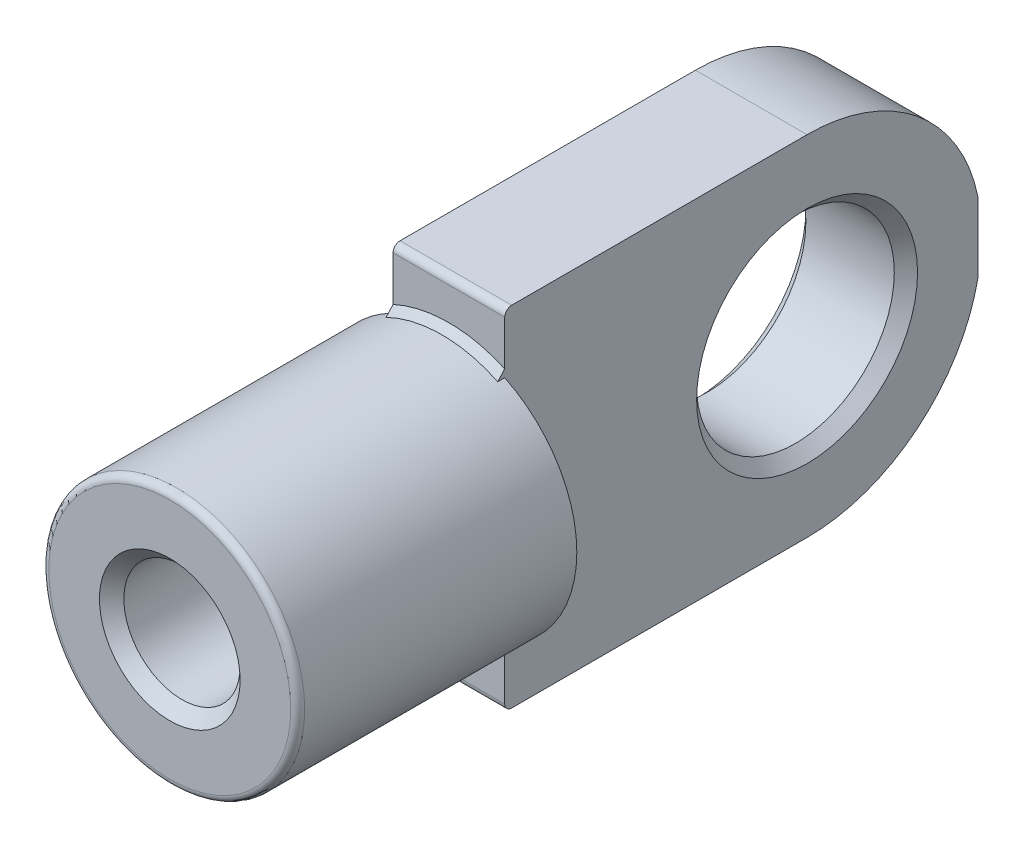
ISO-10303-21;
HEADER;
FILE_DESCRIPTION(('STEP AP214'),'2;1');
FILE_NAME('part.step','',(''),(''),'','','');
FILE_SCHEMA(('AUTOMOTIVE_DESIGN { 1 0 10303 214 1 1 1 1 }'));
ENDSEC;
DATA;
#1=APPLICATION_CONTEXT('core data for automotive mechanical design processes');
#2=APPLICATION_PROTOCOL_DEFINITION('international standard','automotive_design',2000,#1);
#3=PRODUCT_CONTEXT('',#1,'mechanical');
#4=PRODUCT('Part','Part','',(#3));
#5=PRODUCT_RELATED_PRODUCT_CATEGORY('part','',(#4));
#6=PRODUCT_DEFINITION_FORMATION('','',#4);
#7=PRODUCT_DEFINITION_CONTEXT('part definition',#1,'design');
#8=PRODUCT_DEFINITION('design','',#6,#7);
#9=PRODUCT_DEFINITION_SHAPE('','',#8);
#10=(LENGTH_UNIT() NAMED_UNIT(*) SI_UNIT(.MILLI.,.METRE.));
#11=(NAMED_UNIT(*) PLANE_ANGLE_UNIT() SI_UNIT($,.RADIAN.));
#12=(NAMED_UNIT(*) SI_UNIT($,.STERADIAN.) SOLID_ANGLE_UNIT());
#13=UNCERTAINTY_MEASURE_WITH_UNIT(LENGTH_MEASURE(1.E-05),#10,'distance_accuracy_value','');
#14=(GEOMETRIC_REPRESENTATION_CONTEXT(3) GLOBAL_UNCERTAINTY_ASSIGNED_CONTEXT((#13)) GLOBAL_UNIT_ASSIGNED_CONTEXT((#10,
#11,#12)) REPRESENTATION_CONTEXT('',''));
#15=CARTESIAN_POINT('',(0.,0.,0.));
#16=DIRECTION('',(0.,0.,1.));
#17=DIRECTION('',(1.,0.,0.));
#18=AXIS2_PLACEMENT_3D('',#15,#16,#17);
#19=CARTESIAN_POINT('',(-2.4,7.5,13.));
#20=DIRECTION('',(0.,0.,1.));
#21=DIRECTION('',(1.,0.,0.));
#22=AXIS2_PLACEMENT_3D('',#19,#20,#21);
#23=PLANE('',#22);
#24=DIRECTION('',(0.,-1.,0.));
#25=VECTOR('',#24,1.);
#26=CARTESIAN_POINT('',(-2.4,7.5,13.));
#27=LINE('',#26,#25);
#28=CARTESIAN_POINT('',(-2.4,7.2,13.));
#29=VERTEX_POINT('',#28);
#30=CARTESIAN_POINT('',(-2.4,5.28015151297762,13.));
#31=VERTEX_POINT('',#30);
#32=EDGE_CURVE('E207',#29,#31,#27,.T.);
#33=ORIENTED_EDGE('',*,*,#32,.T.);
#34=CARTESIAN_POINT('',(0.,0.,13.));
#35=DIRECTION('',(0.,0.,1.));
#36=DIRECTION('',(1.,0.,0.));
#37=AXIS2_PLACEMENT_3D('',#34,#35,#36);
#38=CIRCLE('',#37,5.79999999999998);
#39=CARTESIAN_POINT('',(2.4,5.28015151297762,13.));
#40=VERTEX_POINT('',#39);
#41=EDGE_CURVE('E296',#31,#40,#38,.F.);
#42=ORIENTED_EDGE('',*,*,#41,.T.);
#43=DIRECTION('',(0.,-1.,0.));
#44=VECTOR('',#43,1.);
#45=CARTESIAN_POINT('',(2.4,7.5,13.));
#46=LINE('',#45,#44);
#47=CARTESIAN_POINT('',(2.4,7.2,13.));
#48=VERTEX_POINT('',#47);
#49=EDGE_CURVE('E189',#48,#40,#46,.T.);
#50=ORIENTED_EDGE('',*,*,#49,.F.);
#51=DIRECTION('',(1.,0.,0.));
#52=VECTOR('',#51,1.);
#53=CARTESIAN_POINT('',(-2.4,7.2,13.));
#54=LINE('',#53,#52);
#55=EDGE_CURVE('E262',#48,#29,#54,.F.);
#56=ORIENTED_EDGE('',*,*,#55,.T.);
#57=EDGE_LOOP('',(#33,#42,#50,#56));
#58=FACE_BOUND('',#57,.T.);
#59=ADVANCED_FACE('F43',(#58),#23,.T.);
#60=CARTESIAN_POINT('',(-2.4,7.5,13.));
#61=DIRECTION('',(0.,1.,0.));
#62=DIRECTION('',(0.,0.,1.));
#63=AXIS2_PLACEMENT_3D('',#60,#61,#62);
#64=PLANE('',#63);
#65=DIRECTION('',(0.,0.,1.));
#66=VECTOR('',#65,1.);
#67=CARTESIAN_POINT('',(-2.4,7.5,13.));
#68=LINE('',#67,#66);
#69=CARTESIAN_POINT('',(-2.4,7.5,0.));
#70=VERTEX_POINT('',#69);
#71=CARTESIAN_POINT('',(-2.4,7.5,12.7));
#72=VERTEX_POINT('',#71);
#73=EDGE_CURVE('E203',#70,#72,#68,.T.);
#74=ORIENTED_EDGE('',*,*,#73,.T.);
#75=DIRECTION('',(1.,0.,0.));
#76=VECTOR('',#75,1.);
#77=CARTESIAN_POINT('',(-2.4,7.5,12.7));
#78=LINE('',#77,#76);
#79=CARTESIAN_POINT('',(2.4,7.5,12.7));
#80=VERTEX_POINT('',#79);
#81=EDGE_CURVE('E259',#72,#80,#78,.T.);
#82=ORIENTED_EDGE('',*,*,#81,.T.);
#83=DIRECTION('',(0.,0.,1.));
#84=VECTOR('',#83,1.);
#85=CARTESIAN_POINT('',(2.4,7.5,13.));
#86=LINE('',#85,#84);
#87=CARTESIAN_POINT('',(2.4,7.5,0.));
#88=VERTEX_POINT('',#87);
#89=EDGE_CURVE('E185',#88,#80,#86,.T.);
#90=ORIENTED_EDGE('',*,*,#89,.F.);
#91=DIRECTION('',(1.,0.,0.));
#92=VECTOR('',#91,1.);
#93=CARTESIAN_POINT('',(-2.4,7.5,0.));
#94=LINE('',#93,#92);
#95=EDGE_CURVE('E222',#70,#88,#94,.T.);
#96=ORIENTED_EDGE('',*,*,#95,.F.);
#97=EDGE_LOOP('',(#74,#82,#90,#96));
#98=FACE_BOUND('',#97,.T.);
#99=ADVANCED_FACE('F393',(#98),#64,.T.);
#100=CARTESIAN_POINT('',(-2.4,0.,0.));
#101=DIRECTION('',(1.,0.,0.));
#102=DIRECTION('',(0.,0.,-1.));
#103=AXIS2_PLACEMENT_3D('',#100,#101,#102);
#104=CYLINDRICAL_SURFACE('',#103,7.5);
#105=CARTESIAN_POINT('',(2.4,0.,0.));
#106=DIRECTION('',(1.,0.,0.));
#107=DIRECTION('',(0.,0.,-1.));
#108=AXIS2_PLACEMENT_3D('',#105,#106,#107);
#109=CIRCLE('',#108,7.5);
#110=CARTESIAN_POINT('',(2.4,1.53060556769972,-7.34215544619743));
#111=VERTEX_POINT('',#110);
#112=EDGE_CURVE('E201',#111,#88,#109,.T.);
#113=ORIENTED_EDGE('',*,*,#112,.F.);
#114=DIRECTION('',(1.,0.,0.));
#115=VECTOR('',#114,1.);
#116=CARTESIAN_POINT('',(-2.4,1.53060556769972,-7.34215544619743));
#117=LINE('',#116,#115);
#118=CARTESIAN_POINT('',(-2.4,1.53060556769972,-7.34215544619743));
#119=VERTEX_POINT('',#118);
#120=EDGE_CURVE('E252',#111,#119,#117,.F.);
#121=ORIENTED_EDGE('',*,*,#120,.T.);
#122=CARTESIAN_POINT('',(-2.4,0.,0.));
#123=DIRECTION('',(1.,0.,0.));
#124=DIRECTION('',(0.,0.,-1.));
#125=AXIS2_PLACEMENT_3D('',#122,#123,#124);
#126=CIRCLE('',#125,7.5);
#127=EDGE_CURVE('E219',#119,#70,#126,.T.);
#128=ORIENTED_EDGE('',*,*,#127,.T.);
#129=ORIENTED_EDGE('',*,*,#95,.T.);
#130=EDGE_LOOP('',(#113,#121,#128,#129));
#131=FACE_BOUND('',#130,.T.);
#132=ADVANCED_FACE('F333',(#131),#104,.T.);
#133=CARTESIAN_POINT('',(-2.4,1.5,-7.34846922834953));
#134=DIRECTION('',(0.,0.,-1.));
#135=DIRECTION('',(-1.,0.,0.));
#136=AXIS2_PLACEMENT_3D('',#133,#134,#135);
#137=PLANE('',#136);
#138=DIRECTION('',(0.,1.,0.));
#139=VECTOR('',#138,1.);
#140=CARTESIAN_POINT('',(2.4,1.5,-7.34846922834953));
#141=LINE('',#140,#139);
#142=CARTESIAN_POINT('',(2.4,-1.46938134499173,-7.34846922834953));
#143=VERTEX_POINT('',#142);
#144=CARTESIAN_POINT('',(2.4,1.46938134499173,-7.34846922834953));
#145=VERTEX_POINT('',#144);
#146=EDGE_CURVE('E198',#143,#145,#141,.T.);
#147=ORIENTED_EDGE('',*,*,#146,.F.);
#148=DIRECTION('',(1.,0.,0.));
#149=VECTOR('',#148,1.);
#150=CARTESIAN_POINT('',(-2.4,-1.46938134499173,-7.34846922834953));
#151=LINE('',#150,#149);
#152=CARTESIAN_POINT('',(-2.4,-1.46938134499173,-7.34846922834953));
#153=VERTEX_POINT('',#152);
#154=EDGE_CURVE('E241',#143,#153,#151,.F.);
#155=ORIENTED_EDGE('',*,*,#154,.T.);
#156=DIRECTION('',(0.,1.,0.));
#157=VECTOR('',#156,1.);
#158=CARTESIAN_POINT('',(-2.4,1.5,-7.34846922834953));
#159=LINE('',#158,#157);
#160=CARTESIAN_POINT('',(-2.4,1.46938134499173,-7.34846922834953));
#161=VERTEX_POINT('',#160);
#162=EDGE_CURVE('E216',#153,#161,#159,.T.);
#163=ORIENTED_EDGE('',*,*,#162,.T.);
#164=DIRECTION('',(1.,0.,0.));
#165=VECTOR('',#164,1.);
#166=CARTESIAN_POINT('',(-2.4,1.46938134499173,-7.34846922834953));
#167=LINE('',#166,#165);
#168=EDGE_CURVE('E238',#161,#145,#167,.T.);
#169=ORIENTED_EDGE('',*,*,#168,.T.);
#170=EDGE_LOOP('',(#147,#155,#163,#169));
#171=FACE_BOUND('',#170,.T.);
#172=ADVANCED_FACE('F378',(#171),#137,.T.);
#173=CARTESIAN_POINT('',(-2.4,0.,0.));
#174=DIRECTION('',(1.,0.,0.));
#175=DIRECTION('',(0.,0.,-1.));
#176=AXIS2_PLACEMENT_3D('',#173,#174,#175);
#177=CYLINDRICAL_SURFACE('',#176,7.5);
#178=CARTESIAN_POINT('',(-2.4,0.,0.));
#179=DIRECTION('',(1.,0.,0.));
#180=DIRECTION('',(0.,0.,-1.));
#181=AXIS2_PLACEMENT_3D('',#178,#179,#180);
#182=CIRCLE('',#181,7.5);
#183=CARTESIAN_POINT('',(-2.4,-7.5,0.));
#184=VERTEX_POINT('',#183);
#185=CARTESIAN_POINT('',(-2.4,-1.53060556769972,-7.34215544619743));
#186=VERTEX_POINT('',#185);
#187=EDGE_CURVE('E213',#184,#186,#182,.T.);
#188=ORIENTED_EDGE('',*,*,#187,.T.);
#189=DIRECTION('',(1.,0.,0.));
#190=VECTOR('',#189,1.);
#191=CARTESIAN_POINT('',(-2.4,-1.53060556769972,-7.34215544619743));
#192=LINE('',#191,#190);
#193=CARTESIAN_POINT('',(2.4,-1.53060556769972,-7.34215544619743));
#194=VERTEX_POINT('',#193);
#195=EDGE_CURVE('E225',#186,#194,#192,.T.);
#196=ORIENTED_EDGE('',*,*,#195,.T.);
#197=CARTESIAN_POINT('',(2.4,0.,0.));
#198=DIRECTION('',(1.,0.,0.));
#199=DIRECTION('',(0.,0.,-1.));
#200=AXIS2_PLACEMENT_3D('',#197,#198,#199);
#201=CIRCLE('',#200,7.5);
#202=CARTESIAN_POINT('',(2.4,-7.5,0.));
#203=VERTEX_POINT('',#202);
#204=EDGE_CURVE('E195',#203,#194,#201,.T.);
#205=ORIENTED_EDGE('',*,*,#204,.F.);
#206=DIRECTION('',(1.,0.,0.));
#207=VECTOR('',#206,1.);
#208=CARTESIAN_POINT('',(-2.4,-7.5,0.));
#209=LINE('',#208,#207);
#210=EDGE_CURVE('E221',#184,#203,#209,.T.);
#211=ORIENTED_EDGE('',*,*,#210,.F.);
#212=EDGE_LOOP('',(#188,#196,#205,#211));
#213=FACE_BOUND('',#212,.T.);
#214=ADVANCED_FACE('F372',(#213),#177,.T.);
#215=CARTESIAN_POINT('',(-2.4,-7.5,13.));
#216=DIRECTION('',(0.,-1.,0.));
#217=DIRECTION('',(0.,0.,-1.));
#218=AXIS2_PLACEMENT_3D('',#215,#216,#217);
#219=PLANE('',#218);
#220=DIRECTION('',(0.,0.,-1.));
#221=VECTOR('',#220,1.);
#222=CARTESIAN_POINT('',(2.4,-7.5,13.));
#223=LINE('',#222,#221);
#224=CARTESIAN_POINT('',(2.4,-7.5,12.7));
#225=VERTEX_POINT('',#224);
#226=EDGE_CURVE('E192',#225,#203,#223,.T.);
#227=ORIENTED_EDGE('',*,*,#226,.F.);
#228=DIRECTION('',(1.,0.,0.));
#229=VECTOR('',#228,1.);
#230=CARTESIAN_POINT('',(-2.4,-7.5,12.7));
#231=LINE('',#230,#229);
#232=CARTESIAN_POINT('',(-2.4,-7.5,12.7));
#233=VERTEX_POINT('',#232);
#234=EDGE_CURVE('E257',#225,#233,#231,.F.);
#235=ORIENTED_EDGE('',*,*,#234,.T.);
#236=DIRECTION('',(0.,0.,-1.));
#237=VECTOR('',#236,1.);
#238=CARTESIAN_POINT('',(-2.4,-7.5,13.));
#239=LINE('',#238,#237);
#240=EDGE_CURVE('E210',#233,#184,#239,.T.);
#241=ORIENTED_EDGE('',*,*,#240,.T.);
#242=ORIENTED_EDGE('',*,*,#210,.T.);
#243=EDGE_LOOP('',(#227,#235,#241,#242));
#244=FACE_BOUND('',#243,.T.);
#245=ADVANCED_FACE('F369',(#244),#219,.T.);
#246=CARTESIAN_POINT('',(2.4,-5.28015151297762,13.));
#247=VERTEX_POINT('',#246);
#248=CARTESIAN_POINT('',(2.4,-7.2,13.));
#249=VERTEX_POINT('',#248);
#250=EDGE_CURVE('E188',#247,#249,#46,.T.);
#251=ORIENTED_EDGE('',*,*,#250,.F.);
#252=CARTESIAN_POINT('',(0.,0.,13.));
#253=DIRECTION('',(0.,0.,1.));
#254=DIRECTION('',(1.,0.,0.));
#255=AXIS2_PLACEMENT_3D('',#252,#253,#254);
#256=CIRCLE('',#255,5.79999999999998);
#257=CARTESIAN_POINT('',(-2.4,-5.28015151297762,13.));
#258=VERTEX_POINT('',#257);
#259=EDGE_CURVE('E294',#247,#258,#256,.F.);
#260=ORIENTED_EDGE('',*,*,#259,.T.);
#261=CARTESIAN_POINT('',(-2.4,-7.2,13.));
#262=VERTEX_POINT('',#261);
#263=EDGE_CURVE('E206',#258,#262,#27,.T.);
#264=ORIENTED_EDGE('',*,*,#263,.T.);
#265=DIRECTION('',(1.,0.,0.));
#266=VECTOR('',#265,1.);
#267=CARTESIAN_POINT('',(-2.4,-7.2,13.));
#268=LINE('',#267,#266);
#269=EDGE_CURVE('E254',#262,#249,#268,.T.);
#270=ORIENTED_EDGE('',*,*,#269,.T.);
#271=EDGE_LOOP('',(#251,#260,#264,#270));
#272=FACE_BOUND('',#271,.T.);
#273=ADVANCED_FACE('F331',(#272),#23,.T.);
#274=CARTESIAN_POINT('',(-2.4,0.,0.));
#275=DIRECTION('',(1.,0.,0.));
#276=DIRECTION('',(0.,0.,-1.));
#277=AXIS2_PLACEMENT_3D('',#274,#275,#276);
#278=PLANE('',#277);
#279=CARTESIAN_POINT('',(-2.4,0.,0.));
#280=DIRECTION('',(1.,0.,0.));
#281=DIRECTION('',(0.,0.,-1.));
#282=AXIS2_PLACEMENT_3D('',#279,#280,#281);
#283=CIRCLE('',#282,4.75);
#284=CARTESIAN_POINT('',(-2.4,0.,-4.75));
#285=VERTEX_POINT('',#284);
#286=EDGE_CURVE('E270',#285,#285,#283,.T.);
#287=ORIENTED_EDGE('',*,*,#286,.T.);
#288=EDGE_LOOP('',(#287));
#289=FACE_BOUND('',#288,.T.);
#290=ORIENTED_EDGE('',*,*,#162,.F.);
#291=CARTESIAN_POINT('',(-2.4,-1.46938134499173,-7.04846922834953));
#292=DIRECTION('',(1.,0.,0.));
#293=DIRECTION('',(0.,0.,-1.));
#294=AXIS2_PLACEMENT_3D('',#291,#292,#293);
#295=CIRCLE('',#294,0.3);
#296=EDGE_CURVE('E250',#153,#186,#295,.F.);
#297=ORIENTED_EDGE('',*,*,#296,.T.);
#298=ORIENTED_EDGE('',*,*,#187,.F.);
#299=ORIENTED_EDGE('',*,*,#240,.F.);
#300=CARTESIAN_POINT('',(-2.4,-7.2,12.7));
#301=DIRECTION('',(1.,0.,0.));
#302=DIRECTION('',(0.,0.,-1.));
#303=AXIS2_PLACEMENT_3D('',#300,#301,#302);
#304=CIRCLE('',#303,0.3);
#305=EDGE_CURVE('E245',#233,#262,#304,.F.);
#306=ORIENTED_EDGE('',*,*,#305,.T.);
#307=ORIENTED_EDGE('',*,*,#263,.F.);
#308=CARTESIAN_POINT('',(-2.4,-5.28015151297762,13.));
#309=CARTESIAN_POINT('',(-2.4,-5.2250613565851,13.050160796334));
#310=CARTESIAN_POINT('',(-2.4,-5.169898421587,13.1002411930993));
#311=CARTESIAN_POINT('',(-2.4,-5.05942698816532,13.2002411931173));
#312=CARTESIAN_POINT('',(-2.4,-5.00411848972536,13.2501607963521));
#313=CARTESIAN_POINT('',(-2.4,-4.94873721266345,13.3));
#314=B_SPLINE_CURVE_WITH_KNOTS('',3,(#308,#309,#310,#311,#312,#313),.UNSPECIFIED.,.F.,.F.,(4,2,
4),(0.,0.223515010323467,0.447030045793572),.UNSPECIFIED.);
#315=CARTESIAN_POINT('',(-2.4,-4.94873721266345,13.3));
#316=VERTEX_POINT('',#315);
#317=EDGE_CURVE('E304',#258,#316,#314,.T.);
#318=ORIENTED_EDGE('',*,*,#317,.T.);
#319=DIRECTION('',(0.,0.,-1.));
#320=VECTOR('',#319,1.);
#321=CARTESIAN_POINT('',(-2.4,-4.94873721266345,13.));
#322=LINE('',#321,#320);
#323=CARTESIAN_POINT('',(-2.4,-4.94873721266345,13.));
#324=VERTEX_POINT('',#323);
#325=EDGE_CURVE('E72',#324,#316,#322,.F.);
#326=ORIENTED_EDGE('',*,*,#325,.F.);
#327=CARTESIAN_POINT('',(-2.4,4.94873721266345,13.));
#328=VERTEX_POINT('',#327);
#329=EDGE_CURVE('E211',#328,#324,#27,.T.);
#330=ORIENTED_EDGE('',*,*,#329,.F.);
#331=DIRECTION('',(0.,0.,-1.));
#332=VECTOR('',#331,1.);
#333=CARTESIAN_POINT('',(-2.4,4.94873721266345,13.3));
#334=LINE('',#333,#332);
#335=CARTESIAN_POINT('',(-2.4,4.94873721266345,13.3));
#336=VERTEX_POINT('',#335);
#337=EDGE_CURVE('E286',#336,#328,#334,.T.);
#338=ORIENTED_EDGE('',*,*,#337,.F.);
#339=CARTESIAN_POINT('',(-2.4,4.94873721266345,13.3));
#340=CARTESIAN_POINT('',(-2.4,5.00411848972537,13.2501607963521));
#341=CARTESIAN_POINT('',(-2.4,5.05942698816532,13.2002411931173));
#342=CARTESIAN_POINT('',(-2.4,5.169898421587,13.1002411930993));
#343=CARTESIAN_POINT('',(-2.4,5.2250613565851,13.050160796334));
#344=CARTESIAN_POINT('',(-2.4,5.28015151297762,13.));
#345=B_SPLINE_CURVE_WITH_KNOTS('',3,(#339,#340,#341,#342,#343,#344),.UNSPECIFIED.,.F.,.F.,(4,2,
4),(0.,0.223515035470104,0.44703004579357),.UNSPECIFIED.);
#346=EDGE_CURVE('E58',#336,#31,#345,.T.);
#347=ORIENTED_EDGE('',*,*,#346,.T.);
#348=ORIENTED_EDGE('',*,*,#32,.F.);
#349=CARTESIAN_POINT('',(-2.4,7.2,12.7));
#350=DIRECTION('',(1.,0.,0.));
#351=DIRECTION('',(0.,0.,-1.));
#352=AXIS2_PLACEMENT_3D('',#349,#350,#351);
#353=CIRCLE('',#352,0.3);
#354=EDGE_CURVE('E243',#29,#72,#353,.F.);
#355=ORIENTED_EDGE('',*,*,#354,.T.);
#356=ORIENTED_EDGE('',*,*,#73,.F.);
#357=ORIENTED_EDGE('',*,*,#127,.F.);
#358=CARTESIAN_POINT('',(-2.4,1.46938134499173,-7.04846922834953));
#359=DIRECTION('',(1.,0.,0.));
#360=DIRECTION('',(0.,0.,-1.));
#361=AXIS2_PLACEMENT_3D('',#358,#359,#360);
#362=CIRCLE('',#361,0.3);
#363=EDGE_CURVE('E248',#119,#161,#362,.F.);
#364=ORIENTED_EDGE('',*,*,#363,.T.);
#365=EDGE_LOOP('',(#290,#297,#298,#299,#306,#307,#318,#326,#330,#338,#347,#348,#355,#356,#357,#364));
#366=FACE_BOUND('',#365,.T.);
#367=ADVANCED_FACE('F326',(#289,#366),#278,.F.);
#368=CARTESIAN_POINT('',(-2.4,0.,0.));
#369=DIRECTION('',(1.,0.,0.));
#370=DIRECTION('',(0.,0.,-1.));
#371=AXIS2_PLACEMENT_3D('',#368,#369,#370);
#372=CYLINDRICAL_SURFACE('',#371,4.25);
#373=CARTESIAN_POINT('',(-1.9,0.,0.));
#374=DIRECTION('',(1.,0.,0.));
#375=DIRECTION('',(0.,0.,-1.));
#376=AXIS2_PLACEMENT_3D('',#373,#374,#375);
#377=CIRCLE('',#376,4.25);
#378=CARTESIAN_POINT('',(-1.9,0.,-4.25));
#379=VERTEX_POINT('',#378);
#380=EDGE_CURVE('E276',#379,#379,#377,.F.);
#381=ORIENTED_EDGE('',*,*,#380,.T.);
#382=EDGE_LOOP('',(#381));
#383=FACE_BOUND('',#382,.T.);
#384=CARTESIAN_POINT('',(1.9,0.,0.));
#385=DIRECTION('',(1.,0.,0.));
#386=DIRECTION('',(0.,0.,-1.));
#387=AXIS2_PLACEMENT_3D('',#384,#385,#386);
#388=CIRCLE('',#387,4.25);
#389=CARTESIAN_POINT('',(1.9,0.,-4.25));
#390=VERTEX_POINT('',#389);
#391=EDGE_CURVE('E273',#390,#390,#388,.T.);
#392=ORIENTED_EDGE('',*,*,#391,.T.);
#393=EDGE_LOOP('',(#392));
#394=FACE_BOUND('',#393,.T.);
#395=ADVANCED_FACE('F320',(#383,#394),#372,.F.);
#396=CARTESIAN_POINT('',(2.4,0.,0.));
#397=DIRECTION('',(1.,0.,0.));
#398=DIRECTION('',(0.,0.,-1.));
#399=AXIS2_PLACEMENT_3D('',#396,#397,#398);
#400=PLANE('',#399);
#401=CARTESIAN_POINT('',(2.4,0.,0.));
#402=DIRECTION('',(1.,0.,0.));
#403=DIRECTION('',(0.,0.,-1.));
#404=AXIS2_PLACEMENT_3D('',#401,#402,#403);
#405=CIRCLE('',#404,4.75);
#406=CARTESIAN_POINT('',(2.4,0.,-4.75));
#407=VERTEX_POINT('',#406);
#408=EDGE_CURVE('E279',#407,#407,#405,.F.);
#409=ORIENTED_EDGE('',*,*,#408,.T.);
#410=EDGE_LOOP('',(#409));
#411=FACE_BOUND('',#410,.T.);
#412=ORIENTED_EDGE('',*,*,#204,.T.);
#413=CARTESIAN_POINT('',(2.4,-1.46938134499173,-7.04846922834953));
#414=DIRECTION('',(1.,0.,0.));
#415=DIRECTION('',(0.,0.,-1.));
#416=AXIS2_PLACEMENT_3D('',#413,#414,#415);
#417=CIRCLE('',#416,0.3);
#418=EDGE_CURVE('E236',#194,#143,#417,.T.);
#419=ORIENTED_EDGE('',*,*,#418,.T.);
#420=ORIENTED_EDGE('',*,*,#146,.T.);
#421=CARTESIAN_POINT('',(2.4,1.46938134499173,-7.04846922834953));
#422=DIRECTION('',(1.,0.,0.));
#423=DIRECTION('',(0.,0.,-1.));
#424=AXIS2_PLACEMENT_3D('',#421,#422,#423);
#425=CIRCLE('',#424,0.3);
#426=EDGE_CURVE('E234',#145,#111,#425,.T.);
#427=ORIENTED_EDGE('',*,*,#426,.T.);
#428=ORIENTED_EDGE('',*,*,#112,.T.);
#429=ORIENTED_EDGE('',*,*,#89,.T.);
#430=CARTESIAN_POINT('',(2.4,7.2,12.7));
#431=DIRECTION('',(1.,0.,0.));
#432=DIRECTION('',(0.,0.,-1.));
#433=AXIS2_PLACEMENT_3D('',#430,#431,#432);
#434=CIRCLE('',#433,0.3);
#435=EDGE_CURVE('E230',#80,#48,#434,.T.);
#436=ORIENTED_EDGE('',*,*,#435,.T.);
#437=ORIENTED_EDGE('',*,*,#49,.T.);
#438=CARTESIAN_POINT('',(2.4,5.28015151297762,13.));
#439=CARTESIAN_POINT('',(2.4,5.2250613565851,13.050160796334));
#440=CARTESIAN_POINT('',(2.4,5.169898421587,13.1002411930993));
#441=CARTESIAN_POINT('',(2.4,5.05942698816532,13.2002411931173));
#442=CARTESIAN_POINT('',(2.4,5.00411848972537,13.2501607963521));
#443=CARTESIAN_POINT('',(2.4,4.94873721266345,13.3));
#444=B_SPLINE_CURVE_WITH_KNOTS('',3,(#438,#439,#440,#441,#442,#443),.UNSPECIFIED.,.F.,.F.,(4,2,
4),(0.,0.223515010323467,0.447030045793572),.UNSPECIFIED.);
#445=CARTESIAN_POINT('',(2.4,4.94873721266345,13.3));
#446=VERTEX_POINT('',#445);
#447=EDGE_CURVE('E11',#40,#446,#444,.T.);
#448=ORIENTED_EDGE('',*,*,#447,.T.);
#449=DIRECTION('',(0.,0.,-1.));
#450=VECTOR('',#449,1.);
#451=CARTESIAN_POINT('',(2.4,4.94873721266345,13.));
#452=LINE('',#451,#450);
#453=CARTESIAN_POINT('',(2.4,4.94873721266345,13.));
#454=VERTEX_POINT('',#453);
#455=EDGE_CURVE('E64',#454,#446,#452,.F.);
#456=ORIENTED_EDGE('',*,*,#455,.F.);
#457=CARTESIAN_POINT('',(2.4,-4.94873721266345,13.));
#458=VERTEX_POINT('',#457);
#459=EDGE_CURVE('E193',#454,#458,#46,.T.);
#460=ORIENTED_EDGE('',*,*,#459,.T.);
#461=DIRECTION('',(0.,0.,-1.));
#462=VECTOR('',#461,1.);
#463=CARTESIAN_POINT('',(2.4,-4.94873721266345,13.3));
#464=LINE('',#463,#462);
#465=CARTESIAN_POINT('',(2.4,-4.94873721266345,13.3));
#466=VERTEX_POINT('',#465);
#467=EDGE_CURVE('E292',#466,#458,#464,.T.);
#468=ORIENTED_EDGE('',*,*,#467,.F.);
#469=CARTESIAN_POINT('',(2.4,-4.94873721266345,13.3));
#470=CARTESIAN_POINT('',(2.4,-5.00411848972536,13.2501607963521));
#471=CARTESIAN_POINT('',(2.4,-5.05942698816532,13.2002411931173));
#472=CARTESIAN_POINT('',(2.4,-5.169898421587,13.1002411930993));
#473=CARTESIAN_POINT('',(2.4,-5.2250613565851,13.050160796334));
#474=CARTESIAN_POINT('',(2.4,-5.28015151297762,13.));
#475=B_SPLINE_CURVE_WITH_KNOTS('',3,(#469,#470,#471,#472,#473,#474),.UNSPECIFIED.,.F.,.F.,(4,2,
4),(0.,0.223515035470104,0.44703004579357),.UNSPECIFIED.);
#476=EDGE_CURVE('E298',#466,#247,#475,.T.);
#477=ORIENTED_EDGE('',*,*,#476,.T.);
#478=ORIENTED_EDGE('',*,*,#250,.T.);
#479=CARTESIAN_POINT('',(2.4,-7.2,12.7));
#480=DIRECTION('',(1.,0.,0.));
#481=DIRECTION('',(0.,0.,-1.));
#482=AXIS2_PLACEMENT_3D('',#479,#480,#481);
#483=CIRCLE('',#482,0.3);
#484=EDGE_CURVE('E232',#249,#225,#483,.T.);
#485=ORIENTED_EDGE('',*,*,#484,.T.);
#486=ORIENTED_EDGE('',*,*,#226,.T.);
#487=EDGE_LOOP('',(#412,#419,#420,#427,#428,#429,#436,#437,#448,#456,#460,#468,#477,#478,#485,#486));
#488=FACE_BOUND('',#487,.T.);
#489=ADVANCED_FACE('F314',(#411,#488),#400,.T.);
#490=CARTESIAN_POINT('',(0.,0.,13.));
#491=DIRECTION('',(0.,0.,1.));
#492=DIRECTION('',(1.,0.,0.));
#493=AXIS2_PLACEMENT_3D('',#490,#491,#492);
#494=PLANE('',#493);
#495=CARTESIAN_POINT('',(0.,0.,13.));
#496=DIRECTION('',(0.,0.,1.));
#497=DIRECTION('',(1.,0.,0.));
#498=AXIS2_PLACEMENT_3D('',#495,#496,#497);
#499=CIRCLE('',#498,5.5);
#500=EDGE_CURVE('E178',#328,#324,#499,.T.);
#501=ORIENTED_EDGE('',*,*,#500,.F.);
#502=ORIENTED_EDGE('',*,*,#329,.T.);
#503=EDGE_LOOP('',(#501,#502));
#504=FACE_BOUND('',#503,.T.);
#505=ADVANCED_FACE('F319',(#504),#494,.F.);
#506=CARTESIAN_POINT('',(0.,0.,25.));
#507=DIRECTION('',(0.,0.,-1.));
#508=DIRECTION('',(-1.,0.,0.));
#509=AXIS2_PLACEMENT_3D('',#506,#507,#508);
#510=CYLINDRICAL_SURFACE('',#509,5.5);
#511=CARTESIAN_POINT('',(0.,0.,24.7));
#512=DIRECTION('',(0.,0.,1.));
#513=DIRECTION('',(1.,0.,0.));
#514=AXIS2_PLACEMENT_3D('',#511,#512,#513);
#515=CIRCLE('',#514,5.5);
#516=CARTESIAN_POINT('',(5.5,0.,24.7));
#517=VERTEX_POINT('',#516);
#518=EDGE_CURVE('E267',#517,#517,#515,.F.);
#519=ORIENTED_EDGE('',*,*,#518,.T.);
#520=EDGE_LOOP('',(#519));
#521=FACE_BOUND('',#520,.T.);
#522=CARTESIAN_POINT('',(0.,0.,13.3));
#523=DIRECTION('',(0.,0.,1.));
#524=DIRECTION('',(1.,0.,0.));
#525=AXIS2_PLACEMENT_3D('',#522,#523,#524);
#526=CIRCLE('',#525,5.5);
#527=EDGE_CURVE('E289',#316,#466,#526,.T.);
#528=ORIENTED_EDGE('',*,*,#527,.T.);
#529=ORIENTED_EDGE('',*,*,#467,.T.);
#530=EDGE_CURVE('E175',#458,#454,#499,.T.);
#531=ORIENTED_EDGE('',*,*,#530,.T.);
#532=ORIENTED_EDGE('',*,*,#455,.T.);
#533=CARTESIAN_POINT('',(0.,0.,13.3));
#534=DIRECTION('',(0.,0.,1.));
#535=DIRECTION('',(1.,0.,0.));
#536=AXIS2_PLACEMENT_3D('',#533,#534,#535);
#537=CIRCLE('',#536,5.5);
#538=EDGE_CURVE('E283',#446,#336,#537,.T.);
#539=ORIENTED_EDGE('',*,*,#538,.T.);
#540=ORIENTED_EDGE('',*,*,#337,.T.);
#541=ORIENTED_EDGE('',*,*,#500,.T.);
#542=ORIENTED_EDGE('',*,*,#325,.T.);
#543=EDGE_LOOP('',(#528,#529,#531,#532,#539,#540,#541,#542));
#544=FACE_BOUND('',#543,.T.);
#545=ADVANCED_FACE('F322',(#521,#544),#510,.T.);
#546=CARTESIAN_POINT('',(0.,0.,25.));
#547=DIRECTION('',(0.,0.,1.));
#548=DIRECTION('',(1.,0.,0.));
#549=AXIS2_PLACEMENT_3D('',#546,#547,#548);
#550=PLANE('',#549);
#551=CARTESIAN_POINT('',(0.,0.,25.));
#552=DIRECTION('',(0.,0.,1.));
#553=DIRECTION('',(1.,0.,0.));
#554=AXIS2_PLACEMENT_3D('',#551,#552,#553);
#555=CIRCLE('',#554,5.2);
#556=CARTESIAN_POINT('',(5.2,0.,25.));
#557=VERTEX_POINT('',#556);
#558=EDGE_CURVE('E264',#557,#557,#555,.T.);
#559=ORIENTED_EDGE('',*,*,#558,.T.);
#560=EDGE_LOOP('',(#559));
#561=FACE_BOUND('',#560,.T.);
#562=CARTESIAN_POINT('',(0.,0.,25.));
#563=DIRECTION('',(0.,0.,1.));
#564=DIRECTION('',(1.,0.,0.));
#565=AXIS2_PLACEMENT_3D('',#562,#563,#564);
#566=CIRCLE('',#565,3.025);
#567=CARTESIAN_POINT('',(3.025,0.,25.));
#568=VERTEX_POINT('',#567);
#569=EDGE_CURVE('E181',#568,#568,#566,.T.);
#570=ORIENTED_EDGE('',*,*,#569,.F.);
#571=EDGE_LOOP('',(#570));
#572=FACE_BOUND('',#571,.T.);
#573=ADVANCED_FACE('F409',(#561,#572),#550,.T.);
#574=ORIENTED_EDGE('',*,*,#459,.F.);
#575=ORIENTED_EDGE('',*,*,#530,.F.);
#576=EDGE_LOOP('',(#574,#575));
#577=FACE_BOUND('',#576,.T.);
#578=ADVANCED_FACE('F169',(#577),#494,.F.);
#579=CARTESIAN_POINT('',(0.,0.,14.));
#580=DIRECTION('',(0.,0.,1.));
#581=DIRECTION('',(1.,0.,0.));
#582=AXIS2_PLACEMENT_3D('',#579,#580,#581);
#583=CONICAL_SURFACE('',#582,2.5,1.22173047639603);
#584=CARTESIAN_POINT('',(0.,0.,13.0900744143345));
#585=VERTEX_POINT('',#584);
#586=VERTEX_LOOP('',#585);
#587=FACE_BOUND('',#586,.T.);
#588=CARTESIAN_POINT('',(0.,0.,14.));
#589=DIRECTION('',(0.,0.,1.));
#590=DIRECTION('',(1.,0.,0.));
#591=AXIS2_PLACEMENT_3D('',#588,#589,#590);
#592=CIRCLE('',#591,2.5);
#593=CARTESIAN_POINT('',(2.5,0.,14.));
#594=VERTEX_POINT('',#593);
#595=EDGE_CURVE('E173',#594,#594,#592,.T.);
#596=ORIENTED_EDGE('',*,*,#595,.T.);
#597=EDGE_LOOP('',(#596));
#598=FACE_BOUND('',#597,.T.);
#599=ADVANCED_FACE('F165',(#587,#598),#583,.F.);
#600=CARTESIAN_POINT('',(0.,0.,25.));
#601=DIRECTION('',(0.,0.,1.));
#602=DIRECTION('',(1.,0.,0.));
#603=AXIS2_PLACEMENT_3D('',#600,#601,#602);
#604=CYLINDRICAL_SURFACE('',#603,2.5);
#605=ORIENTED_EDGE('',*,*,#595,.F.);
#606=EDGE_LOOP('',(#605));
#607=FACE_BOUND('',#606,.T.);
#608=CARTESIAN_POINT('',(0.,0.,24.475));
#609=DIRECTION('',(0.,0.,1.));
#610=DIRECTION('',(1.,0.,0.));
#611=AXIS2_PLACEMENT_3D('',#608,#609,#610);
#612=CIRCLE('',#611,2.5);
#613=CARTESIAN_POINT('',(2.5,0.,24.475));
#614=VERTEX_POINT('',#613);
#615=EDGE_CURVE('E176',#614,#614,#612,.T.);
#616=ORIENTED_EDGE('',*,*,#615,.T.);
#617=EDGE_LOOP('',(#616));
#618=FACE_BOUND('',#617,.T.);
#619=ADVANCED_FACE('F168',(#607,#618),#604,.F.);
#620=CARTESIAN_POINT('',(0.,0.,25.));
#621=DIRECTION('',(0.,0.,1.));
#622=DIRECTION('',(1.,0.,0.));
#623=AXIS2_PLACEMENT_3D('',#620,#621,#622);
#624=CONICAL_SURFACE('',#623,3.025,0.785398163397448);
#625=ORIENTED_EDGE('',*,*,#615,.F.);
#626=EDGE_LOOP('',(#625));
#627=FACE_BOUND('',#626,.T.);
#628=ORIENTED_EDGE('',*,*,#569,.T.);
#629=EDGE_LOOP('',(#628));
#630=FACE_BOUND('',#629,.T.);
#631=ADVANCED_FACE('F443',(#627,#630),#624,.F.);
#632=CARTESIAN_POINT('',(-2.4,-1.46938134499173,-7.04846922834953));
#633=DIRECTION('',(1.,0.,0.));
#634=DIRECTION('',(0.,0.,-1.));
#635=AXIS2_PLACEMENT_3D('',#632,#633,#634);
#636=CYLINDRICAL_SURFACE('',#635,0.3);
#637=ORIENTED_EDGE('',*,*,#296,.F.);
#638=ORIENTED_EDGE('',*,*,#154,.F.);
#639=ORIENTED_EDGE('',*,*,#418,.F.);
#640=ORIENTED_EDGE('',*,*,#195,.F.);
#641=EDGE_LOOP('',(#637,#638,#639,#640));
#642=FACE_BOUND('',#641,.T.);
#643=ADVANCED_FACE('F381',(#642),#636,.T.);
#644=CARTESIAN_POINT('',(-2.4,1.46938134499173,-7.04846922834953));
#645=DIRECTION('',(1.,0.,0.));
#646=DIRECTION('',(0.,0.,-1.));
#647=AXIS2_PLACEMENT_3D('',#644,#645,#646);
#648=CYLINDRICAL_SURFACE('',#647,0.3);
#649=ORIENTED_EDGE('',*,*,#363,.F.);
#650=ORIENTED_EDGE('',*,*,#120,.F.);
#651=ORIENTED_EDGE('',*,*,#426,.F.);
#652=ORIENTED_EDGE('',*,*,#168,.F.);
#653=EDGE_LOOP('',(#649,#650,#651,#652));
#654=FACE_BOUND('',#653,.T.);
#655=ADVANCED_FACE('F385',(#654),#648,.T.);
#656=CARTESIAN_POINT('',(-2.4,-7.2,12.7));
#657=DIRECTION('',(1.,0.,0.));
#658=DIRECTION('',(0.,0.,-1.));
#659=AXIS2_PLACEMENT_3D('',#656,#657,#658);
#660=CYLINDRICAL_SURFACE('',#659,0.3);
#661=ORIENTED_EDGE('',*,*,#305,.F.);
#662=ORIENTED_EDGE('',*,*,#234,.F.);
#663=ORIENTED_EDGE('',*,*,#484,.F.);
#664=ORIENTED_EDGE('',*,*,#269,.F.);
#665=EDGE_LOOP('',(#661,#662,#663,#664));
#666=FACE_BOUND('',#665,.T.);
#667=ADVANCED_FACE('F364',(#666),#660,.T.);
#668=CARTESIAN_POINT('',(-2.4,7.2,12.7));
#669=DIRECTION('',(1.,0.,0.));
#670=DIRECTION('',(0.,0.,-1.));
#671=AXIS2_PLACEMENT_3D('',#668,#669,#670);
#672=CYLINDRICAL_SURFACE('',#671,0.3);
#673=ORIENTED_EDGE('',*,*,#354,.F.);
#674=ORIENTED_EDGE('',*,*,#55,.F.);
#675=ORIENTED_EDGE('',*,*,#435,.F.);
#676=ORIENTED_EDGE('',*,*,#81,.F.);
#677=EDGE_LOOP('',(#673,#674,#675,#676));
#678=FACE_BOUND('',#677,.T.);
#679=ADVANCED_FACE('F402',(#678),#672,.T.);
#680=CARTESIAN_POINT('',(0.,0.,24.7));
#681=DIRECTION('',(0.,0.,1.));
#682=DIRECTION('',(1.,0.,0.));
#683=AXIS2_PLACEMENT_3D('',#680,#681,#682);
#684=TOROIDAL_SURFACE('',#683,5.2,0.3);
#685=ORIENTED_EDGE('',*,*,#518,.F.);
#686=EDGE_LOOP('',(#685));
#687=FACE_BOUND('',#686,.T.);
#688=ORIENTED_EDGE('',*,*,#558,.F.);
#689=EDGE_LOOP('',(#688));
#690=FACE_BOUND('',#689,.T.);
#691=ADVANCED_FACE('F529',(#687,#690),#684,.T.);
#692=CARTESIAN_POINT('',(-2.4,0.,0.));
#693=DIRECTION('',(-1.,0.,0.));
#694=DIRECTION('',(0.,0.,1.));
#695=AXIS2_PLACEMENT_3D('',#692,#693,#694);
#696=CONICAL_SURFACE('',#695,4.75,0.785398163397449);
#697=ORIENTED_EDGE('',*,*,#380,.F.);
#698=EDGE_LOOP('',(#697));
#699=FACE_BOUND('',#698,.T.);
#700=ORIENTED_EDGE('',*,*,#286,.F.);
#701=EDGE_LOOP('',(#700));
#702=FACE_BOUND('',#701,.T.);
#703=ADVANCED_FACE('F538',(#699,#702),#696,.F.);
#704=CARTESIAN_POINT('',(1.9,0.,0.));
#705=DIRECTION('',(1.,0.,0.));
#706=DIRECTION('',(0.,0.,-1.));
#707=AXIS2_PLACEMENT_3D('',#704,#705,#706);
#708=CONICAL_SURFACE('',#707,4.25,0.785398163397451);
#709=ORIENTED_EDGE('',*,*,#408,.F.);
#710=EDGE_LOOP('',(#709));
#711=FACE_BOUND('',#710,.T.);
#712=ORIENTED_EDGE('',*,*,#391,.F.);
#713=EDGE_LOOP('',(#712));
#714=FACE_BOUND('',#713,.T.);
#715=ADVANCED_FACE('F555',(#711,#714),#708,.F.);
#716=CARTESIAN_POINT('',(0.,0.,13.3));
#717=DIRECTION('',(0.,0.,-1.));
#718=DIRECTION('',(-1.,0.,0.));
#719=AXIS2_PLACEMENT_3D('',#716,#717,#718);
#720=CONICAL_SURFACE('',#719,5.5,0.785398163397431);
#721=ORIENTED_EDGE('',*,*,#317,.F.);
#722=ORIENTED_EDGE('',*,*,#259,.F.);
#723=ORIENTED_EDGE('',*,*,#476,.F.);
#724=ORIENTED_EDGE('',*,*,#527,.F.);
#725=EDGE_LOOP('',(#721,#722,#723,#724));
#726=FACE_BOUND('',#725,.T.);
#727=ADVANCED_FACE('F311',(#726),#720,.T.);
#728=CARTESIAN_POINT('',(0.,0.,13.3));
#729=DIRECTION('',(0.,0.,-1.));
#730=DIRECTION('',(-1.,0.,0.));
#731=AXIS2_PLACEMENT_3D('',#728,#729,#730);
#732=CONICAL_SURFACE('',#731,5.5,0.785398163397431);
#733=ORIENTED_EDGE('',*,*,#447,.F.);
#734=ORIENTED_EDGE('',*,*,#41,.F.);
#735=ORIENTED_EDGE('',*,*,#346,.F.);
#736=ORIENTED_EDGE('',*,*,#538,.F.);
#737=EDGE_LOOP('',(#733,#734,#735,#736));
#738=FACE_BOUND('',#737,.T.);
#739=ADVANCED_FACE('F46',(#738),#732,.T.);
#740=CLOSED_SHELL('',(#59,#99,#132,#172,#214,#245,#273,#367,#395,#489,#505,#545,#573,#578,#599,
#619,#631,#643,#655,#667,#679,#691,#703,#715,#727,#739));
#741=MANIFOLD_SOLID_BREP('B2',#740);
#742=ADVANCED_BREP_SHAPE_REPRESENTATION('',(#18,#741),#14);
#743=SHAPE_DEFINITION_REPRESENTATION(#9,#742);
ENDSEC;
END-ISO-10303-21;
